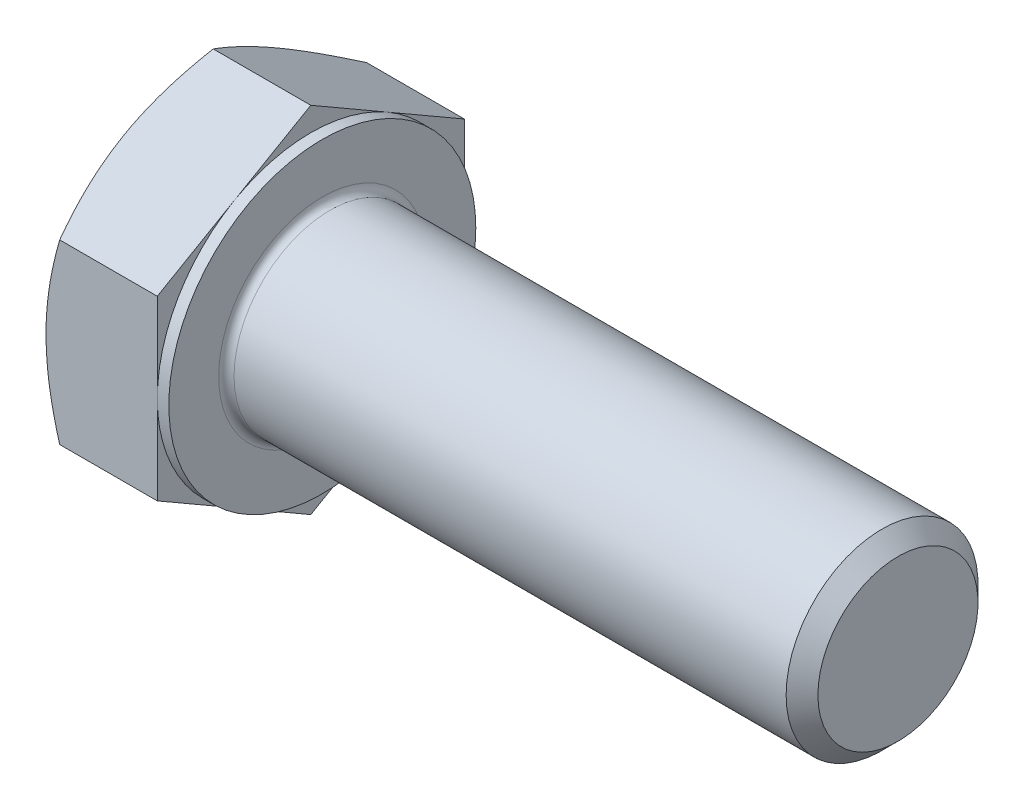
ISO-10303-21;
HEADER;
FILE_DESCRIPTION(('STEP AP214'),'2;1');
FILE_NAME('part.step','',(''),(''),'','','');
FILE_SCHEMA(('AUTOMOTIVE_DESIGN { 1 0 10303 214 1 1 1 1 }'));
ENDSEC;
DATA;
#1=APPLICATION_CONTEXT('core data for automotive mechanical design processes');
#2=APPLICATION_PROTOCOL_DEFINITION('international standard','automotive_design',2000,#1);
#3=PRODUCT_CONTEXT('',#1,'mechanical');
#4=PRODUCT('Part','Part','',(#3));
#5=PRODUCT_RELATED_PRODUCT_CATEGORY('part','',(#4));
#6=PRODUCT_DEFINITION_FORMATION('','',#4);
#7=PRODUCT_DEFINITION_CONTEXT('part definition',#1,'design');
#8=PRODUCT_DEFINITION('design','',#6,#7);
#9=PRODUCT_DEFINITION_SHAPE('','',#8);
#10=(LENGTH_UNIT() NAMED_UNIT(*) SI_UNIT(.MILLI.,.METRE.));
#11=(NAMED_UNIT(*) PLANE_ANGLE_UNIT() SI_UNIT($,.RADIAN.));
#12=(NAMED_UNIT(*) SI_UNIT($,.STERADIAN.) SOLID_ANGLE_UNIT());
#13=UNCERTAINTY_MEASURE_WITH_UNIT(LENGTH_MEASURE(1.E-05),#10,'distance_accuracy_value','');
#14=(GEOMETRIC_REPRESENTATION_CONTEXT(3) GLOBAL_UNCERTAINTY_ASSIGNED_CONTEXT((#13)) GLOBAL_UNIT_ASSIGNED_CONTEXT((#10,
#11,#12)) REPRESENTATION_CONTEXT('',''));
#15=CARTESIAN_POINT('',(0.,0.,0.));
#16=DIRECTION('',(0.,0.,1.));
#17=DIRECTION('',(1.,0.,0.));
#18=AXIS2_PLACEMENT_3D('',#15,#16,#17);
#19=CARTESIAN_POINT('',(6.4,9.23760430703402,0.));
#20=DIRECTION('',(1.,0.,0.));
#21=DIRECTION('',(0.,0.,-1.));
#22=AXIS2_PLACEMENT_3D('',#19,#20,#21);
#23=PLANE('',#22);
#24=CARTESIAN_POINT('',(6.4,0.,0.));
#25=DIRECTION('',(1.,0.,0.));
#26=DIRECTION('',(0.,0.,-1.));
#27=AXIS2_PLACEMENT_3D('',#24,#25,#26);
#28=CIRCLE('',#27,5.4);
#29=CARTESIAN_POINT('',(6.4,0.,-5.4));
#30=VERTEX_POINT('',#29);
#31=EDGE_CURVE('E35',#30,#30,#28,.F.);
#32=ORIENTED_EDGE('',*,*,#31,.T.);
#33=EDGE_LOOP('',(#32));
#34=FACE_BOUND('',#33,.T.);
#35=CARTESIAN_POINT('',(6.4,0.,0.));
#36=DIRECTION('',(1.,0.,0.));
#37=DIRECTION('',(0.,0.,-1.));
#38=AXIS2_PLACEMENT_3D('',#35,#36,#37);
#39=CIRCLE('',#38,8.);
#40=CARTESIAN_POINT('',(6.4,0.,-8.));
#41=VERTEX_POINT('',#40);
#42=EDGE_CURVE('E248',#41,#41,#39,.T.);
#43=ORIENTED_EDGE('',*,*,#42,.T.);
#44=EDGE_LOOP('',(#43));
#45=FACE_BOUND('',#44,.T.);
#46=ADVANCED_FACE('F26',(#34,#45),#23,.T.);
#47=CARTESIAN_POINT('',(0.,0.,0.));
#48=DIRECTION('',(-1.,0.,0.));
#49=DIRECTION('',(0.,0.,1.));
#50=AXIS2_PLACEMENT_3D('',#47,#48,#49);
#51=CYLINDRICAL_SURFACE('',#50,5.);
#52=CARTESIAN_POINT('',(6.8,0.,0.));
#53=DIRECTION('',(1.,0.,0.));
#54=DIRECTION('',(0.,0.,-1.));
#55=AXIS2_PLACEMENT_3D('',#52,#53,#54);
#56=CIRCLE('',#55,5.);
#57=CARTESIAN_POINT('',(6.8,0.,-5.));
#58=VERTEX_POINT('',#57);
#59=EDGE_CURVE('E11',#58,#58,#56,.T.);
#60=ORIENTED_EDGE('',*,*,#59,.T.);
#61=EDGE_LOOP('',(#60));
#62=FACE_BOUND('',#61,.T.);
#63=CARTESIAN_POINT('',(35.572,0.,0.));
#64=DIRECTION('',(-1.,0.,0.));
#65=DIRECTION('',(0.,0.,1.));
#66=AXIS2_PLACEMENT_3D('',#63,#64,#65);
#67=CIRCLE('',#66,5.);
#68=CARTESIAN_POINT('',(35.572,0.,5.));
#69=VERTEX_POINT('',#68);
#70=EDGE_CURVE('E292',#69,#69,#67,.T.);
#71=ORIENTED_EDGE('',*,*,#70,.T.);
#72=EDGE_LOOP('',(#71));
#73=FACE_BOUND('',#72,.T.);
#74=ADVANCED_FACE('F235',(#62,#73),#51,.T.);
#75=CARTESIAN_POINT('',(36.4,0.,0.));
#76=DIRECTION('',(-1.,0.,0.));
#77=DIRECTION('',(0.,0.,1.));
#78=AXIS2_PLACEMENT_3D('',#75,#76,#77);
#79=CONICAL_SURFACE('',#78,4.172,0.78539816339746);
#80=ORIENTED_EDGE('',*,*,#70,.F.);
#81=EDGE_LOOP('',(#80));
#82=FACE_BOUND('',#81,.T.);
#83=CARTESIAN_POINT('',(36.4,0.,0.));
#84=DIRECTION('',(-1.,0.,0.));
#85=DIRECTION('',(0.,0.,1.));
#86=AXIS2_PLACEMENT_3D('',#83,#84,#85);
#87=CIRCLE('',#86,4.172);
#88=CARTESIAN_POINT('',(36.4,0.,4.172));
#89=VERTEX_POINT('',#88);
#90=EDGE_CURVE('E294',#89,#89,#87,.T.);
#91=ORIENTED_EDGE('',*,*,#90,.T.);
#92=EDGE_LOOP('',(#91));
#93=FACE_BOUND('',#92,.T.);
#94=ADVANCED_FACE('F240',(#82,#93),#79,.T.);
#95=CARTESIAN_POINT('',(36.4,0.,0.));
#96=DIRECTION('',(-1.,0.,0.));
#97=DIRECTION('',(0.,0.,1.));
#98=AXIS2_PLACEMENT_3D('',#95,#96,#97);
#99=PLANE('',#98);
#100=ORIENTED_EDGE('',*,*,#90,.F.);
#101=EDGE_LOOP('',(#100));
#102=FACE_BOUND('',#101,.T.);
#103=ADVANCED_FACE('F341',(#102),#99,.F.);
#104=CARTESIAN_POINT('',(5.8,8.,0.));
#105=DIRECTION('',(1.,0.,0.));
#106=DIRECTION('',(0.,0.,-1.));
#107=AXIS2_PLACEMENT_3D('',#104,#105,#106);
#108=PLANE('',#107);
#109=DIRECTION('',(0.,0.500000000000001,0.866025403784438));
#110=VECTOR('',#109,1.);
#111=CARTESIAN_POINT('',(5.8,4.618802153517,-8.));
#112=LINE('',#111,#110);
#113=CARTESIAN_POINT('',(5.8,4.618802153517,-8.));
#114=VERTEX_POINT('',#113);
#115=CARTESIAN_POINT('',(5.8,6.92820323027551,-4.00000000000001));
#116=VERTEX_POINT('',#115);
#117=EDGE_CURVE('E159',#114,#116,#112,.T.);
#118=ORIENTED_EDGE('',*,*,#117,.T.);
#119=CARTESIAN_POINT('',(5.8,0.,0.));
#120=DIRECTION('',(-1.,0.,0.));
#121=DIRECTION('',(0.,0.,1.));
#122=AXIS2_PLACEMENT_3D('',#119,#120,#121);
#123=CIRCLE('',#122,8.);
#124=CARTESIAN_POINT('',(5.8,0.,-8.));
#125=VERTEX_POINT('',#124);
#126=EDGE_CURVE('E42',#116,#125,#123,.T.);
#127=ORIENTED_EDGE('',*,*,#126,.T.);
#128=DIRECTION('',(0.,1.,0.));
#129=VECTOR('',#128,1.);
#130=CARTESIAN_POINT('',(5.8,4.618802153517,-8.));
#131=LINE('',#130,#129);
#132=EDGE_CURVE('E249',#125,#114,#131,.T.);
#133=ORIENTED_EDGE('',*,*,#132,.T.);
#134=EDGE_LOOP('',(#118,#127,#133));
#135=FACE_BOUND('',#134,.T.);
#136=ADVANCED_FACE('F271',(#135),#108,.T.);
#137=CARTESIAN_POINT('',(5.8,9.23760430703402,0.));
#138=VERTEX_POINT('',#137);
#139=EDGE_CURVE('E157',#116,#138,#112,.T.);
#140=ORIENTED_EDGE('',*,*,#139,.T.);
#141=DIRECTION('',(0.,-0.500000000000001,0.866025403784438));
#142=VECTOR('',#141,1.);
#143=CARTESIAN_POINT('',(5.8,9.23760430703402,0.));
#144=LINE('',#143,#142);
#145=CARTESIAN_POINT('',(5.8,6.92820323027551,4.00000000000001));
#146=VERTEX_POINT('',#145);
#147=EDGE_CURVE('E156',#138,#146,#144,.T.);
#148=ORIENTED_EDGE('',*,*,#147,.T.);
#149=EDGE_CURVE('E145',#146,#116,#123,.T.);
#150=ORIENTED_EDGE('',*,*,#149,.T.);
#151=EDGE_LOOP('',(#140,#148,#150));
#152=FACE_BOUND('',#151,.T.);
#153=ADVANCED_FACE('F278',(#152),#108,.T.);
#154=CARTESIAN_POINT('',(5.8,4.61880215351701,8.));
#155=VERTEX_POINT('',#154);
#156=EDGE_CURVE('E124',#146,#155,#144,.T.);
#157=ORIENTED_EDGE('',*,*,#156,.T.);
#158=DIRECTION('',(0.,-1.,0.));
#159=VECTOR('',#158,1.);
#160=CARTESIAN_POINT('',(5.8,4.61880215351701,8.));
#161=LINE('',#160,#159);
#162=CARTESIAN_POINT('',(5.8,0.,8.));
#163=VERTEX_POINT('',#162);
#164=EDGE_CURVE('E118',#155,#163,#161,.T.);
#165=ORIENTED_EDGE('',*,*,#164,.T.);
#166=EDGE_CURVE('E122',#163,#146,#123,.T.);
#167=ORIENTED_EDGE('',*,*,#166,.T.);
#168=EDGE_LOOP('',(#157,#165,#167));
#169=FACE_BOUND('',#168,.T.);
#170=ADVANCED_FACE('F120',(#169),#108,.T.);
#171=CARTESIAN_POINT('',(5.8,-4.61880215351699,8.));
#172=VERTEX_POINT('',#171);
#173=EDGE_CURVE('E128',#163,#172,#161,.T.);
#174=ORIENTED_EDGE('',*,*,#173,.T.);
#175=DIRECTION('',(0.,-0.500000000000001,-0.866025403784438));
#176=VECTOR('',#175,1.);
#177=CARTESIAN_POINT('',(5.8,-9.23760430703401,0.));
#178=LINE('',#177,#176);
#179=CARTESIAN_POINT('',(5.8,-6.92820323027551,4.00000000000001));
#180=VERTEX_POINT('',#179);
#181=EDGE_CURVE('E135',#172,#180,#178,.T.);
#182=ORIENTED_EDGE('',*,*,#181,.T.);
#183=EDGE_CURVE('E132',#180,#163,#123,.T.);
#184=ORIENTED_EDGE('',*,*,#183,.T.);
#185=EDGE_LOOP('',(#174,#182,#184));
#186=FACE_BOUND('',#185,.T.);
#187=ADVANCED_FACE('F133',(#186),#108,.T.);
#188=CARTESIAN_POINT('',(5.8,-9.23760430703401,0.));
#189=VERTEX_POINT('',#188);
#190=EDGE_CURVE('E151',#180,#189,#178,.T.);
#191=ORIENTED_EDGE('',*,*,#190,.T.);
#192=DIRECTION('',(0.,0.5,-0.866025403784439));
#193=VECTOR('',#192,1.);
#194=CARTESIAN_POINT('',(5.8,-4.61880215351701,-8.));
#195=LINE('',#194,#193);
#196=CARTESIAN_POINT('',(5.8,-6.92820323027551,-4.));
#197=VERTEX_POINT('',#196);
#198=EDGE_CURVE('E332',#189,#197,#195,.T.);
#199=ORIENTED_EDGE('',*,*,#198,.T.);
#200=EDGE_CURVE('E139',#197,#180,#123,.T.);
#201=ORIENTED_EDGE('',*,*,#200,.T.);
#202=EDGE_LOOP('',(#191,#199,#201));
#203=FACE_BOUND('',#202,.T.);
#204=ADVANCED_FACE('F333',(#203),#108,.T.);
#205=CARTESIAN_POINT('',(5.8,-4.61880215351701,-8.));
#206=VERTEX_POINT('',#205);
#207=EDGE_CURVE('E146',#197,#206,#195,.T.);
#208=ORIENTED_EDGE('',*,*,#207,.T.);
#209=EDGE_CURVE('E252',#206,#125,#131,.T.);
#210=ORIENTED_EDGE('',*,*,#209,.T.);
#211=EDGE_CURVE('E264',#125,#197,#123,.T.);
#212=ORIENTED_EDGE('',*,*,#211,.T.);
#213=EDGE_LOOP('',(#208,#210,#212));
#214=FACE_BOUND('',#213,.T.);
#215=ADVANCED_FACE('F263',(#214),#108,.T.);
#216=CARTESIAN_POINT('',(0.,0.,0.));
#217=DIRECTION('',(-1.,0.,0.));
#218=DIRECTION('',(0.,0.,1.));
#219=AXIS2_PLACEMENT_3D('',#216,#217,#218);
#220=CYLINDRICAL_SURFACE('',#219,8.);
#221=ORIENTED_EDGE('',*,*,#126,.F.);
#222=ORIENTED_EDGE('',*,*,#149,.F.);
#223=ORIENTED_EDGE('',*,*,#166,.F.);
#224=ORIENTED_EDGE('',*,*,#183,.F.);
#225=ORIENTED_EDGE('',*,*,#200,.F.);
#226=ORIENTED_EDGE('',*,*,#211,.F.);
#227=EDGE_LOOP('',(#221,#222,#223,#224,#225,#226));
#228=FACE_BOUND('',#227,.T.);
#229=ORIENTED_EDGE('',*,*,#42,.F.);
#230=EDGE_LOOP('',(#229));
#231=FACE_BOUND('',#230,.T.);
#232=ADVANCED_FACE('F142',(#228,#231),#220,.T.);
#233=CARTESIAN_POINT('',(0.,9.23760430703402,0.));
#234=DIRECTION('',(1.,0.,0.));
#235=DIRECTION('',(0.,0.,-1.));
#236=AXIS2_PLACEMENT_3D('',#233,#234,#235);
#237=PLANE('',#236);
#238=CARTESIAN_POINT('',(0.,0.,0.));
#239=DIRECTION('',(1.,0.,0.));
#240=DIRECTION('',(0.,0.,-1.));
#241=AXIS2_PLACEMENT_3D('',#238,#239,#240);
#242=CIRCLE('',#241,8.);
#243=CARTESIAN_POINT('',(0.,0.,-8.));
#244=VERTEX_POINT('',#243);
#245=CARTESIAN_POINT('',(0.,6.92820323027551,-4.00000000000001));
#246=VERTEX_POINT('',#245);
#247=EDGE_CURVE('E250',#244,#246,#242,.T.);
#248=ORIENTED_EDGE('',*,*,#247,.F.);
#249=CARTESIAN_POINT('',(0.,-6.92820323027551,-4.));
#250=VERTEX_POINT('',#249);
#251=EDGE_CURVE('E256',#250,#244,#242,.T.);
#252=ORIENTED_EDGE('',*,*,#251,.F.);
#253=CARTESIAN_POINT('',(0.,-6.9282032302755,4.00000000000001));
#254=VERTEX_POINT('',#253);
#255=EDGE_CURVE('E314',#254,#250,#242,.T.);
#256=ORIENTED_EDGE('',*,*,#255,.F.);
#257=CARTESIAN_POINT('',(0.,0.,8.));
#258=VERTEX_POINT('',#257);
#259=EDGE_CURVE('E310',#258,#254,#242,.T.);
#260=ORIENTED_EDGE('',*,*,#259,.F.);
#261=CARTESIAN_POINT('',(0.,0.,0.));
#262=DIRECTION('',(-1.,0.,0.));
#263=DIRECTION('',(0.,0.,1.));
#264=AXIS2_PLACEMENT_3D('',#261,#262,#263);
#265=CIRCLE('',#264,8.);
#266=CARTESIAN_POINT('',(0.,6.92820323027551,4.00000000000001));
#267=VERTEX_POINT('',#266);
#268=EDGE_CURVE('E160',#258,#267,#265,.T.);
#269=ORIENTED_EDGE('',*,*,#268,.T.);
#270=EDGE_CURVE('E254',#246,#267,#242,.T.);
#271=ORIENTED_EDGE('',*,*,#270,.F.);
#272=EDGE_LOOP('',(#248,#252,#256,#260,#269,#271));
#273=FACE_BOUND('',#272,.T.);
#274=ADVANCED_FACE('F311',(#273),#237,.F.);
#275=CARTESIAN_POINT('',(0.,0.,0.));
#276=DIRECTION('',(1.,0.,0.));
#277=DIRECTION('',(0.,0.,-1.));
#278=AXIS2_PLACEMENT_3D('',#275,#276,#277);
#279=CONICAL_SURFACE('',#278,8.,1.0471975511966);
#280=CARTESIAN_POINT('',(0.714597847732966,4.61868668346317,8.0002));
#281=CARTESIAN_POINT('',(0.655990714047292,4.72021302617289,7.8243512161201));
#282=CARTESIAN_POINT('',(0.600043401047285,4.82211789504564,7.64784680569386));
#283=CARTESIAN_POINT('',(0.494201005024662,5.02675523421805,7.29340453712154));
#284=CARTESIAN_POINT('',(0.444308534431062,5.12948804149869,7.11546609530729));
#285=CARTESIAN_POINT('',(0.304692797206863,5.43933133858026,6.57880176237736));
#286=CARTESIAN_POINT('',(0.225281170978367,5.64766491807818,6.21795741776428));
#287=CARTESIAN_POINT('',(0.132161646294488,5.95943209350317,5.67796082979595));
#288=CARTESIAN_POINT('',(0.105634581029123,6.06193429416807,5.50042181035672));
#289=CARTESIAN_POINT('',(0.0611531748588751,6.26740224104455,5.1445408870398));
#290=CARTESIAN_POINT('',(0.04319807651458,6.37036794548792,4.96619905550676));
#291=CARTESIAN_POINT('',(0.0163156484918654,6.57647664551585,4.60920831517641));
#292=CARTESIAN_POINT('',(0.00737807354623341,6.67961930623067,4.4305599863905));
#293=CARTESIAN_POINT('',(-0.00127769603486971,6.88599991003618,4.07309829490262));
#294=CARTESIAN_POINT('',(-0.000996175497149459,6.98923785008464,3.89428493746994));
#295=CARTESIAN_POINT('',(0.00814502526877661,7.18224506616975,3.5599866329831));
#296=CARTESIAN_POINT('',(0.0158896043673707,7.27202796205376,3.40447809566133));
#297=CARTESIAN_POINT('',(0.0382011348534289,7.45138347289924,3.09382523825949));
#298=CARTESIAN_POINT('',(0.0527685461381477,7.54095607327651,2.93868094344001));
#299=CARTESIAN_POINT('',(0.106360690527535,7.80932710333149,2.47384868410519));
#300=CARTESIAN_POINT('',(0.155268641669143,7.98765049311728,2.16498351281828));
#301=CARTESIAN_POINT('',(0.277539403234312,8.34618890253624,1.5439767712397));
#302=CARTESIAN_POINT('',(0.351420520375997,8.52635816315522,1.23191445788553));
#303=CARTESIAN_POINT('',(0.519100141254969,8.88400987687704,0.612443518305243));
#304=CARTESIAN_POINT('',(0.612859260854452,9.06149691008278,0.30502695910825));
#305=CARTESIAN_POINT('',(0.714597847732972,9.23771977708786,-0.00019999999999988));
#306=B_SPLINE_CURVE_WITH_KNOTS('',3,(#280,#281,#282,#283,#284,#285,#286,#287,#288,#289,#290,
#291,#292,#293,#294,#295,#296,#297,#298,#299,#300,#301,#302,#303,#304,#305),.UNSPECIFIED.,.F.,
.F.,(4,2,2,2,2,2,2,2,2,2,2,2,4),(0.,0.633973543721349,1.26821965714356,2.53934712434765,
3.15934343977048,3.77928496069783,4.39852133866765,5.01773858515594,5.55680239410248,
6.09590254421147,7.17487077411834,8.27776850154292,9.37850115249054),.UNSPECIFIED.);
#307=CARTESIAN_POINT('',(0.714531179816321,9.23760430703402,0.));
#308=VERTEX_POINT('',#307);
#309=EDGE_CURVE('E206',#267,#308,#306,.T.);
#310=ORIENTED_EDGE('',*,*,#309,.T.);
#311=CARTESIAN_POINT('',(0.714597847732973,9.23771977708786,0.0002));
#312=CARTESIAN_POINT('',(0.655990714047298,9.13619343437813,-0.175648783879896));
#313=CARTESIAN_POINT('',(0.60004340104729,9.03428856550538,-0.352153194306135));
#314=CARTESIAN_POINT('',(0.494201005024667,8.82965122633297,-0.706595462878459));
#315=CARTESIAN_POINT('',(0.444308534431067,8.72691841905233,-0.884533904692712));
#316=CARTESIAN_POINT('',(0.304692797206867,8.41707512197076,-1.42119823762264));
#317=CARTESIAN_POINT('',(0.22528117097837,8.20874154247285,-1.78204258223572));
#318=CARTESIAN_POINT('',(0.13216164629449,7.89697436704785,-2.32203917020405));
#319=CARTESIAN_POINT('',(0.105634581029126,7.79447216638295,-2.49957818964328));
#320=CARTESIAN_POINT('',(0.0611531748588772,7.58900421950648,-2.8554591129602));
#321=CARTESIAN_POINT('',(0.0431980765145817,7.4860385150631,-3.03380094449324));
#322=CARTESIAN_POINT('',(0.0163156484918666,7.27992981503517,-3.39079168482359));
#323=CARTESIAN_POINT('',(0.00737807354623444,7.17678715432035,-3.5694400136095));
#324=CARTESIAN_POINT('',(-0.00127769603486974,6.97040655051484,-3.92690170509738));
#325=CARTESIAN_POINT('',(-0.00099617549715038,6.86716861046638,-4.10571506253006));
#326=CARTESIAN_POINT('',(0.00814502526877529,6.67416139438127,-4.4400133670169));
#327=CARTESIAN_POINT('',(0.0158896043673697,6.58437849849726,-4.59552190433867));
#328=CARTESIAN_POINT('',(0.0382011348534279,6.40502298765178,-4.90617476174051));
#329=CARTESIAN_POINT('',(0.0527685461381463,6.31545038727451,-5.06131905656));
#330=CARTESIAN_POINT('',(0.106360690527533,6.04707935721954,-5.52615131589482));
#331=CARTESIAN_POINT('',(0.155268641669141,5.86875596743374,-5.83501648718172));
#332=CARTESIAN_POINT('',(0.277539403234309,5.51021755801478,-6.4560232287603));
#333=CARTESIAN_POINT('',(0.351420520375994,5.3300482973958,-6.76808554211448));
#334=CARTESIAN_POINT('',(0.519100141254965,4.97239658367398,-7.38755648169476));
#335=CARTESIAN_POINT('',(0.612859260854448,4.79490955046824,-7.69497304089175));
#336=CARTESIAN_POINT('',(0.714597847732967,4.61868668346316,-8.0002));
#337=B_SPLINE_CURVE_WITH_KNOTS('',3,(#311,#312,#313,#314,#315,#316,#317,#318,#319,#320,#321,
#322,#323,#324,#325,#326,#327,#328,#329,#330,#331,#332,#333,#334,#335,#336),.UNSPECIFIED.,.F.,
.F.,(4,2,2,2,2,2,2,2,2,2,2,2,4),(0.,0.633973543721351,1.26821965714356,2.53934712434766,
3.15934343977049,3.77928496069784,4.39852133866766,5.01773858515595,5.55680239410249,
6.09590254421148,7.17487077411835,8.27776850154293,9.37850115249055),.UNSPECIFIED.);
#338=EDGE_CURVE('E50',#308,#246,#337,.T.);
#339=ORIENTED_EDGE('',*,*,#338,.T.);
#340=ORIENTED_EDGE('',*,*,#270,.T.);
#341=EDGE_LOOP('',(#310,#339,#340));
#342=FACE_BOUND('',#341,.T.);
#343=ADVANCED_FACE('F308',(#342),#279,.T.);
#344=CARTESIAN_POINT('',(4.02490591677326,-12.6546855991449,8.));
#345=CARTESIAN_POINT('',(3.85338488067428,-12.3031246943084,8.));
#346=CARTESIAN_POINT('',(3.68343820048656,-11.9507829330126,8.));
#347=CARTESIAN_POINT('',(3.3475742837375,-11.2441233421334,8.));
#348=CARTESIAN_POINT('',(3.18165763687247,-10.8898052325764,8.));
#349=CARTESIAN_POINT('',(2.85395194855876,-10.1770689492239,8.));
#350=CARTESIAN_POINT('',(2.69218825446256,-9.81863908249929,8.));
#351=CARTESIAN_POINT('',(2.37495727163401,-9.09901413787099,8.));
#352=CARTESIAN_POINT('',(2.21948970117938,-8.73781918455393,8.));
#353=CARTESIAN_POINT('',(1.91124909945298,-7.9995005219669,8.));
#354=CARTESIAN_POINT('',(1.75875676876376,-7.6222589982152,8.));
#355=CARTESIAN_POINT('',(1.46472411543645,-6.86345577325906,8.));
#356=CARTESIAN_POINT('',(1.323184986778,-6.48189360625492,8.));
#357=CARTESIAN_POINT('',(1.05459432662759,-5.71447512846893,8.));
#358=CARTESIAN_POINT('',(0.927515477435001,-5.32862847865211,8.));
#359=CARTESIAN_POINT('',(0.69175721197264,-4.55141880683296,8.));
#360=CARTESIAN_POINT('',(0.583072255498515,-4.16005748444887,8.));
#361=CARTESIAN_POINT('',(0.389750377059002,-3.37376378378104,8.));
#362=CARTESIAN_POINT('',(0.304973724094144,-2.97886668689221,8.));
#363=CARTESIAN_POINT('',(0.199275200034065,-2.38273452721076,8.));
#364=CARTESIAN_POINT('',(0.167618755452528,-2.18337977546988,8.));
#365=CARTESIAN_POINT('',(0.112075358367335,-1.78359737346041,8.));
#366=CARTESIAN_POINT('',(0.0881876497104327,-1.58316982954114,8.));
#367=CARTESIAN_POINT('',(0.0489706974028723,-1.184235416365,8.));
#368=CARTESIAN_POINT('',(0.0335291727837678,-0.985739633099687,8.));
#369=CARTESIAN_POINT('',(0.0110629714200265,-0.58827208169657,8.));
#370=CARTESIAN_POINT('',(0.00403814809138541,-0.38930032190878,8.));
#371=CARTESIAN_POINT('',(-0.00142584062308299,0.00876221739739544,8.));
#372=CARTESIAN_POINT('',(0.000134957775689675,0.207852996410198,8.));
#373=CARTESIAN_POINT('',(0.0118014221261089,0.605786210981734,8.));
#374=CARTESIAN_POINT('',(0.0219074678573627,0.804628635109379,8.));
#375=CARTESIAN_POINT('',(0.0557165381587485,1.27520492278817,8.));
#376=CARTESIAN_POINT('',(0.0830672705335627,1.5466829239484,8.));
#377=CARTESIAN_POINT('',(0.152259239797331,2.08777093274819,8.));
#378=CARTESIAN_POINT('',(0.194102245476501,2.35738070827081,8.));
#379=CARTESIAN_POINT('',(0.33916319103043,3.1630177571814,7.99999999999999));
#380=CARTESIAN_POINT('',(0.461891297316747,3.69558689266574,8.));
#381=CARTESIAN_POINT('',(0.676586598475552,4.49226054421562,8.));
#382=CARTESIAN_POINT('',(0.754301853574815,4.76044513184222,8.));
#383=CARTESIAN_POINT('',(0.918275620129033,5.29421545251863,8.));
#384=CARTESIAN_POINT('',(1.00453419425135,5.55980116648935,8.));
#385=CARTESIAN_POINT('',(1.1841720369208,6.08844838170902,8.));
#386=CARTESIAN_POINT('',(1.27754932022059,6.35151056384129,8.));
#387=CARTESIAN_POINT('',(1.47027925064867,6.8754242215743,8.));
#388=CARTESIAN_POINT('',(1.56963178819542,7.1362757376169,7.99999999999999));
#389=CARTESIAN_POINT('',(1.83061788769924,7.80218876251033,7.99999999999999));
#390=CARTESIAN_POINT('',(1.99585031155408,8.20583801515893,7.99999999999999));
#391=CARTESIAN_POINT('',(2.33560644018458,9.00922091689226,7.99999999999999));
#392=CARTESIAN_POINT('',(2.51013099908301,9.40895420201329,7.99999999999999));
#393=CARTESIAN_POINT('',(2.86641485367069,10.2053302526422,7.99999999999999));
#394=CARTESIAN_POINT('',(3.04817649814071,10.6019719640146,7.99999999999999));
#395=CARTESIAN_POINT('',(3.41731475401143,11.3926098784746,7.99999999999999));
#396=CARTESIAN_POINT('',(3.60469118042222,11.7866061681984,7.99999999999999));
#397=CARTESIAN_POINT('',(3.98417977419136,12.5730081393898,7.99999999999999));
#398=CARTESIAN_POINT('',(4.17629838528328,12.9654107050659,7.99999999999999));
#399=CARTESIAN_POINT('',(4.56413461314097,13.7484335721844,7.99999999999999));
#400=CARTESIAN_POINT('',(4.75985225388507,14.1390538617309,7.99999999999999));
#401=CARTESIAN_POINT('',(5.15417791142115,14.9187387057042,7.99999999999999));
#402=CARTESIAN_POINT('',(5.35278537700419,15.3078035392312,7.99999999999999));
#403=CARTESIAN_POINT('',(5.75241278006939,16.0846929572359,7.99999999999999));
#404=CARTESIAN_POINT('',(5.95343272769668,16.4725175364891,7.99999999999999));
#405=CARTESIAN_POINT('',(6.52023158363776,17.559169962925,7.99999999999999));
#406=CARTESIAN_POINT('',(6.88826669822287,18.2568208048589,7.99999999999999));
#407=CARTESIAN_POINT('',(7.62911646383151,19.6496204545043,7.99999999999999));
#408=CARTESIAN_POINT('',(8.00193136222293,20.3447691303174,7.99999999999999));
#409=CARTESIAN_POINT('',(8.74998840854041,21.7309493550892,7.99999999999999));
#410=CARTESIAN_POINT('',(9.12521930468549,22.4219869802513,7.99999999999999));
#411=CARTESIAN_POINT('',(9.69012626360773,23.4573861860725,7.99999999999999));
#412=CARTESIAN_POINT('',(9.87876537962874,23.8023143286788,7.99999999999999));
#413=CARTESIAN_POINT('',(10.2566598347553,24.491832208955,7.99999999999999));
#414=CARTESIAN_POINT('',(10.4459151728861,24.8364219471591,7.99999999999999));
#415=CARTESIAN_POINT('',(10.6354414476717,25.1808626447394,7.99999999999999));
#416=B_SPLINE_CURVE_WITH_KNOTS('',3,(#344,#345,#346,#347,#348,#349,#350,#351,#352,#353,#354,
#355,#356,#357,#358,#359,#360,#361,#362,#363,#364,#365,#366,#367,#368,#369,#370,#371,#372,#373,
#374,#375,#376,#377,#378,#379,#380,#381,#382,#383,#384,#385,#386,#387,#388,#389,#390,#391,#392,
#393,#394,#395,#396,#397,#398,#399,#400,#401,#402,#403,#404,#405,#406,#407,#408,#409,#410,#411,
#412,#413,#414,#415),.UNSPECIFIED.,.F.,.F.,(4,2,2,2,2,2,2,2,2,2,2,2,2,2,2,2,2,2,2,2,2,2,2,2,2,2,
2,2,2,2,2,2,2,2,2,4),(0.,1.17352534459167,2.34722138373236,3.52689945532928,4.70652468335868,
5.92708318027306,7.14777454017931,8.36612013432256,9.58409810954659,10.7948027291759,
11.40023293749,12.0056041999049,12.6027191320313,13.1998236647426,13.7969256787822,
14.3940542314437,15.2121538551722,16.0303533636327,17.6675489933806,18.5051258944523,
19.3427089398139,20.180059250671,21.0173942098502,22.3257038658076,23.6341339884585,
24.9429922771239,26.2518074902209,27.5625113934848,28.8732240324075,30.1836898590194,
31.4941611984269,33.8604586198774,36.2268790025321,38.5858914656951,39.7653151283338,
40.9447369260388),.UNSPECIFIED.);
#417=CARTESIAN_POINT('',(0.714531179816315,4.61880215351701,8.));
#418=VERTEX_POINT('',#417);
#419=EDGE_CURVE('E218',#258,#418,#416,.T.);
#420=ORIENTED_EDGE('',*,*,#419,.T.);
#421=EDGE_CURVE('E217',#418,#267,#306,.T.);
#422=ORIENTED_EDGE('',*,*,#421,.T.);
#423=ORIENTED_EDGE('',*,*,#268,.F.);
#424=EDGE_LOOP('',(#420,#422,#423));
#425=FACE_BOUND('',#424,.T.);
#426=ADVANCED_FACE('F305',(#425),#279,.T.);
#427=CARTESIAN_POINT('',(0.714531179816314,-4.61880215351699,8.));
#428=VERTEX_POINT('',#427);
#429=EDGE_CURVE('E296',#428,#258,#416,.T.);
#430=ORIENTED_EDGE('',*,*,#429,.T.);
#431=ORIENTED_EDGE('',*,*,#259,.T.);
#432=CARTESIAN_POINT('',(0.714597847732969,-9.23771977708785,-0.000199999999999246));
#433=CARTESIAN_POINT('',(0.655990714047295,-9.13619343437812,0.175648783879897));
#434=CARTESIAN_POINT('',(0.600043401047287,-9.03428856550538,0.352153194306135));
#435=CARTESIAN_POINT('',(0.494201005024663,-8.82965122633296,0.706595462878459));
#436=CARTESIAN_POINT('',(0.444308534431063,-8.72691841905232,0.884533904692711));
#437=CARTESIAN_POINT('',(0.304692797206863,-8.41707512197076,1.42119823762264));
#438=CARTESIAN_POINT('',(0.225281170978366,-8.20874154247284,1.78204258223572));
#439=CARTESIAN_POINT('',(0.132161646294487,-7.89697436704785,2.32203917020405));
#440=CARTESIAN_POINT('',(0.105634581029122,-7.79447216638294,2.49957818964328));
#441=CARTESIAN_POINT('',(0.0611531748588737,-7.58900421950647,2.8554591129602));
#442=CARTESIAN_POINT('',(0.0431980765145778,-7.4860385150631,3.03380094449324));
#443=CARTESIAN_POINT('',(0.0163156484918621,-7.27992981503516,3.39079168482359));
#444=CARTESIAN_POINT('',(0.00737807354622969,-7.17678715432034,3.5694400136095));
#445=CARTESIAN_POINT('',(-0.00127769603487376,-6.97040655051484,3.92690170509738));
#446=CARTESIAN_POINT('',(-0.000996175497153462,-6.86716861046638,4.10571506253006));
#447=CARTESIAN_POINT('',(0.00814502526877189,-6.67416139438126,4.4400133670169));
#448=CARTESIAN_POINT('',(0.0158896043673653,-6.58437849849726,4.59552190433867));
#449=CARTESIAN_POINT('',(0.0382011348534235,-6.40502298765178,4.90617476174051));
#450=CARTESIAN_POINT('',(0.052768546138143,-6.31545038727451,5.06131905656));
#451=CARTESIAN_POINT('',(0.106360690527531,-6.04707935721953,5.52615131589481));
#452=CARTESIAN_POINT('',(0.155268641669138,-5.86875596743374,5.83501648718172));
#453=CARTESIAN_POINT('',(0.277539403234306,-5.51021755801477,6.4560232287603));
#454=CARTESIAN_POINT('',(0.351420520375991,-5.3300482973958,6.76808554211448));
#455=CARTESIAN_POINT('',(0.519100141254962,-4.97239658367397,7.38755648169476));
#456=CARTESIAN_POINT('',(0.612859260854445,-4.79490955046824,7.69497304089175));
#457=CARTESIAN_POINT('',(0.714597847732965,-4.61868668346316,8.0002));
#458=B_SPLINE_CURVE_WITH_KNOTS('',3,(#432,#433,#434,#435,#436,#437,#438,#439,#440,#441,#442,
#443,#444,#445,#446,#447,#448,#449,#450,#451,#452,#453,#454,#455,#456,#457),.UNSPECIFIED.,.F.,
.F.,(4,2,2,2,2,2,2,2,2,2,2,2,4),(0.,0.63397354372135,1.26821965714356,2.53934712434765,
3.15934343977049,3.77928496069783,4.39852133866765,5.01773858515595,5.55680239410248,
6.09590254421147,7.17487077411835,8.27776850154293,9.37850115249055),.UNSPECIFIED.);
#459=EDGE_CURVE('E208',#254,#428,#458,.T.);
#460=ORIENTED_EDGE('',*,*,#459,.T.);
#461=EDGE_LOOP('',(#430,#431,#460));
#462=FACE_BOUND('',#461,.T.);
#463=ADVANCED_FACE('F178',(#462),#279,.T.);
#464=CARTESIAN_POINT('',(0.714531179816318,-9.23760430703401,0.));
#465=VERTEX_POINT('',#464);
#466=EDGE_CURVE('E201',#465,#254,#458,.T.);
#467=ORIENTED_EDGE('',*,*,#466,.T.);
#468=ORIENTED_EDGE('',*,*,#255,.T.);
#469=CARTESIAN_POINT('',(0.71459784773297,-4.61868668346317,-8.0002));
#470=CARTESIAN_POINT('',(0.655990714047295,-4.7202130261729,-7.82435121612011));
#471=CARTESIAN_POINT('',(0.600043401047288,-4.82211789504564,-7.64784680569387));
#472=CARTESIAN_POINT('',(0.494201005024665,-5.02675523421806,-7.29340453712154));
#473=CARTESIAN_POINT('',(0.444308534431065,-5.1294880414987,-7.11546609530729));
#474=CARTESIAN_POINT('',(0.304692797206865,-5.43933133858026,-6.57880176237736));
#475=CARTESIAN_POINT('',(0.225281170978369,-5.64766491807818,-6.21795741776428));
#476=CARTESIAN_POINT('',(0.132161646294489,-5.95943209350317,-5.67796082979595));
#477=CARTESIAN_POINT('',(0.105634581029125,-6.06193429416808,-5.50042181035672));
#478=CARTESIAN_POINT('',(0.0611531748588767,-6.26740224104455,-5.1445408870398));
#479=CARTESIAN_POINT('',(0.0431980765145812,-6.37036794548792,-4.96619905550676));
#480=CARTESIAN_POINT('',(0.0163156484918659,-6.57647664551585,-4.60920831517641));
#481=CARTESIAN_POINT('',(0.00737807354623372,-6.67961930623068,-4.4305599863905));
#482=CARTESIAN_POINT('',(-0.00127769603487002,-6.88599991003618,-4.07309829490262));
#483=CARTESIAN_POINT('',(-0.000996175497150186,-6.98923785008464,-3.89428493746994));
#484=CARTESIAN_POINT('',(0.00814502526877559,-7.18224506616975,-3.5599866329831));
#485=CARTESIAN_POINT('',(0.0158896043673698,-7.27202796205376,-3.40447809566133));
#486=CARTESIAN_POINT('',(0.0382011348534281,-7.45138347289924,-3.09382523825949));
#487=CARTESIAN_POINT('',(0.052768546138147,-7.54095607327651,-2.93868094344));
#488=CARTESIAN_POINT('',(0.106360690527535,-7.80932710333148,-2.47384868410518));
#489=CARTESIAN_POINT('',(0.155268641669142,-7.98765049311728,-2.16498351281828));
#490=CARTESIAN_POINT('',(0.27753940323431,-8.34618890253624,-1.5439767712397));
#491=CARTESIAN_POINT('',(0.351420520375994,-8.52635816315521,-1.23191445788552));
#492=CARTESIAN_POINT('',(0.519100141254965,-8.88400987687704,-0.61244351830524));
#493=CARTESIAN_POINT('',(0.612859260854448,-9.06149691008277,-0.305026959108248));
#494=CARTESIAN_POINT('',(0.714597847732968,-9.23771977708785,0.000200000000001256));
#495=B_SPLINE_CURVE_WITH_KNOTS('',3,(#469,#470,#471,#472,#473,#474,#475,#476,#477,#478,#479,
#480,#481,#482,#483,#484,#485,#486,#487,#488,#489,#490,#491,#492,#493,#494),.UNSPECIFIED.,.F.,
.F.,(4,2,2,2,2,2,2,2,2,2,2,2,4),(0.,0.633973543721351,1.26821965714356,2.53934712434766,
3.15934343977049,3.77928496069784,4.39852133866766,5.01773858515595,5.55680239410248,
6.09590254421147,7.17487077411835,8.27776850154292,9.37850115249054),.UNSPECIFIED.);
#496=EDGE_CURVE('E207',#250,#465,#495,.T.);
#497=ORIENTED_EDGE('',*,*,#496,.T.);
#498=EDGE_LOOP('',(#467,#468,#497));
#499=FACE_BOUND('',#498,.T.);
#500=ADVANCED_FACE('F328',(#499),#279,.T.);
#501=CARTESIAN_POINT('',(0.714531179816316,4.618802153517,-8.));
#502=VERTEX_POINT('',#501);
#503=EDGE_CURVE('E209',#246,#502,#337,.T.);
#504=ORIENTED_EDGE('',*,*,#503,.T.);
#505=CARTESIAN_POINT('',(4.02490591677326,-12.6546855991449,-8.));
#506=CARTESIAN_POINT('',(3.85338488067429,-12.3031246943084,-8.));
#507=CARTESIAN_POINT('',(3.68343820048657,-11.9507829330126,-8.));
#508=CARTESIAN_POINT('',(3.34757428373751,-11.2441233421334,-8.));
#509=CARTESIAN_POINT('',(3.18165763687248,-10.8898052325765,-8.));
#510=CARTESIAN_POINT('',(2.85395194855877,-10.177068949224,-8.));
#511=CARTESIAN_POINT('',(2.69218825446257,-9.8186390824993,-8.));
#512=CARTESIAN_POINT('',(2.37495727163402,-9.099014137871,-8.));
#513=CARTESIAN_POINT('',(2.21948970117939,-8.73781918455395,-8.));
#514=CARTESIAN_POINT('',(1.91124909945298,-7.99950052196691,-8.));
#515=CARTESIAN_POINT('',(1.75875676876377,-7.62225899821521,-8.));
#516=CARTESIAN_POINT('',(1.46472411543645,-6.86345577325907,-8.));
#517=CARTESIAN_POINT('',(1.323184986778,-6.48189360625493,-8.));
#518=CARTESIAN_POINT('',(1.05459432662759,-5.71447512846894,-8.));
#519=CARTESIAN_POINT('',(0.927515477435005,-5.32862847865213,-8.));
#520=CARTESIAN_POINT('',(0.691757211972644,-4.55141880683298,-8.));
#521=CARTESIAN_POINT('',(0.58307225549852,-4.16005748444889,-8.));
#522=CARTESIAN_POINT('',(0.389750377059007,-3.37376378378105,-8.));
#523=CARTESIAN_POINT('',(0.304973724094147,-2.97886668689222,-8.));
#524=CARTESIAN_POINT('',(0.199275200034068,-2.38273452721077,-8.));
#525=CARTESIAN_POINT('',(0.167618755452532,-2.18337977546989,-8.));
#526=CARTESIAN_POINT('',(0.112075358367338,-1.78359737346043,-8.));
#527=CARTESIAN_POINT('',(0.0881876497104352,-1.58316982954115,-8.));
#528=CARTESIAN_POINT('',(0.0489706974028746,-1.18423541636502,-8.));
#529=CARTESIAN_POINT('',(0.0335291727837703,-0.9857396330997,-8.));
#530=CARTESIAN_POINT('',(0.0110629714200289,-0.588272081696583,-8.));
#531=CARTESIAN_POINT('',(0.00403814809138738,-0.389300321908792,-8.));
#532=CARTESIAN_POINT('',(-0.001425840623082,0.00876221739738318,-8.));
#533=CARTESIAN_POINT('',(0.000134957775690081,0.207852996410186,-8.));
#534=CARTESIAN_POINT('',(0.0118014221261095,0.605786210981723,-8.));
#535=CARTESIAN_POINT('',(0.0219074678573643,0.804628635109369,-8.));
#536=CARTESIAN_POINT('',(0.0557165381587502,1.27520492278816,-8.));
#537=CARTESIAN_POINT('',(0.0830672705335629,1.54668292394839,-8.));
#538=CARTESIAN_POINT('',(0.15225923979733,2.08777093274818,-8.));
#539=CARTESIAN_POINT('',(0.194102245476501,2.3573807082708,-8.));
#540=CARTESIAN_POINT('',(0.339163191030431,3.16301775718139,-8.));
#541=CARTESIAN_POINT('',(0.461891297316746,3.69558689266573,-8.));
#542=CARTESIAN_POINT('',(0.676586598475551,4.49226054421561,-8.));
#543=CARTESIAN_POINT('',(0.754301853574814,4.76044513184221,-8.));
#544=CARTESIAN_POINT('',(0.918275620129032,5.29421545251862,-8.));
#545=CARTESIAN_POINT('',(1.00453419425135,5.55980116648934,-8.));
#546=CARTESIAN_POINT('',(1.1841720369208,6.088448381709,-8.));
#547=CARTESIAN_POINT('',(1.27754932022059,6.35151056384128,-8.));
#548=CARTESIAN_POINT('',(1.47027925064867,6.87542422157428,-8.));
#549=CARTESIAN_POINT('',(1.56963178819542,7.13627573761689,-8.));
#550=CARTESIAN_POINT('',(1.83061788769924,7.80218876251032,-8.));
#551=CARTESIAN_POINT('',(1.99585031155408,8.20583801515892,-8.));
#552=CARTESIAN_POINT('',(2.33560644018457,9.00922091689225,-8.));
#553=CARTESIAN_POINT('',(2.51013099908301,9.40895420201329,-8.));
#554=CARTESIAN_POINT('',(2.86641485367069,10.2053302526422,-8.));
#555=CARTESIAN_POINT('',(3.04817649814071,10.6019719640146,-8.));
#556=CARTESIAN_POINT('',(3.41731475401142,11.3926098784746,-8.));
#557=CARTESIAN_POINT('',(3.60469118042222,11.7866061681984,-8.));
#558=CARTESIAN_POINT('',(3.98417977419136,12.5730081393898,-8.));
#559=CARTESIAN_POINT('',(4.17629838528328,12.9654107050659,-8.));
#560=CARTESIAN_POINT('',(4.56413461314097,13.7484335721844,-8.));
#561=CARTESIAN_POINT('',(4.75985225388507,14.1390538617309,-8.));
#562=CARTESIAN_POINT('',(5.15417791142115,14.9187387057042,-8.));
#563=CARTESIAN_POINT('',(5.3527853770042,15.3078035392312,-8.));
#564=CARTESIAN_POINT('',(5.75241278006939,16.0846929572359,-8.));
#565=CARTESIAN_POINT('',(5.95343272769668,16.4725175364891,-8.));
#566=CARTESIAN_POINT('',(6.52023158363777,17.559169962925,-8.));
#567=CARTESIAN_POINT('',(6.88826669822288,18.2568208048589,-8.));
#568=CARTESIAN_POINT('',(7.62911646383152,19.6496204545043,-8.));
#569=CARTESIAN_POINT('',(8.00193136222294,20.3447691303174,-8.));
#570=CARTESIAN_POINT('',(8.74998840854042,21.7309493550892,-8.));
#571=CARTESIAN_POINT('',(9.12521930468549,22.4219869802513,-8.));
#572=CARTESIAN_POINT('',(9.69012626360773,23.4573861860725,-8.));
#573=CARTESIAN_POINT('',(9.87876537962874,23.8023143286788,-8.));
#574=CARTESIAN_POINT('',(10.2566598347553,24.491832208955,-8.));
#575=CARTESIAN_POINT('',(10.4459151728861,24.8364219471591,-8.));
#576=CARTESIAN_POINT('',(10.6354414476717,25.1808626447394,-8.));
#577=B_SPLINE_CURVE_WITH_KNOTS('',3,(#505,#506,#507,#508,#509,#510,#511,#512,#513,#514,#515,
#516,#517,#518,#519,#520,#521,#522,#523,#524,#525,#526,#527,#528,#529,#530,#531,#532,#533,#534,
#535,#536,#537,#538,#539,#540,#541,#542,#543,#544,#545,#546,#547,#548,#549,#550,#551,#552,#553,
#554,#555,#556,#557,#558,#559,#560,#561,#562,#563,#564,#565,#566,#567,#568,#569,#570,#571,#572,
#573,#574,#575,#576),.UNSPECIFIED.,.F.,.F.,(4,2,2,2,2,2,2,2,2,2,2,2,2,2,2,2,2,2,2,2,2,2,2,2,2,2,
2,2,2,2,2,2,2,2,2,4),(0.,1.17352534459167,2.34722138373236,3.52689945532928,4.70652468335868,
5.92708318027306,7.14777454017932,8.36612013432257,9.58409810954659,10.7948027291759,
11.40023293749,12.0056041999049,12.6027191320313,13.1998236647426,13.7969256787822,
14.3940542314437,15.2121538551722,16.0303533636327,17.6675489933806,18.5051258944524,
19.3427089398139,20.180059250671,21.0173942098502,22.3257038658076,23.6341339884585,
24.9429922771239,26.2518074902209,27.5625113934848,28.8732240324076,30.1836898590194,
31.4941611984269,33.8604586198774,36.2268790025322,38.5858914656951,39.7653151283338,
40.9447369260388),.UNSPECIFIED.);
#578=EDGE_CURVE('E171',#502,#244,#577,.F.);
#579=ORIENTED_EDGE('',*,*,#578,.T.);
#580=ORIENTED_EDGE('',*,*,#247,.T.);
#581=EDGE_LOOP('',(#504,#579,#580));
#582=FACE_BOUND('',#581,.T.);
#583=ADVANCED_FACE('F325',(#582),#279,.T.);
#584=CARTESIAN_POINT('',(0.714531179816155,-4.61880215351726,-8.));
#585=VERTEX_POINT('',#584);
#586=EDGE_CURVE('E172',#585,#250,#495,.T.);
#587=ORIENTED_EDGE('',*,*,#586,.T.);
#588=ORIENTED_EDGE('',*,*,#251,.T.);
#589=EDGE_CURVE('E163',#244,#585,#577,.F.);
#590=ORIENTED_EDGE('',*,*,#589,.T.);
#591=EDGE_LOOP('',(#587,#588,#590));
#592=FACE_BOUND('',#591,.T.);
#593=ADVANCED_FACE('F187',(#592),#279,.T.);
#594=CARTESIAN_POINT('',(6.4,4.618802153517,-8.));
#595=DIRECTION('',(0.,0.,1.));
#596=DIRECTION('',(0.,-1.,0.));
#597=AXIS2_PLACEMENT_3D('',#594,#595,#596);
#598=PLANE('',#597);
#599=ORIENTED_EDGE('',*,*,#209,.F.);
#600=DIRECTION('',(-1.,0.,0.));
#601=VECTOR('',#600,1.);
#602=CARTESIAN_POINT('',(6.4,-4.61880215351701,-8.));
#603=LINE('',#602,#601);
#604=EDGE_CURVE('E289',#206,#585,#603,.T.);
#605=ORIENTED_EDGE('',*,*,#604,.T.);
#606=ORIENTED_EDGE('',*,*,#589,.F.);
#607=ORIENTED_EDGE('',*,*,#578,.F.);
#608=DIRECTION('',(-1.,0.,0.));
#609=VECTOR('',#608,1.);
#610=CARTESIAN_POINT('',(6.4,4.618802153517,-8.));
#611=LINE('',#610,#609);
#612=EDGE_CURVE('E269',#114,#502,#611,.T.);
#613=ORIENTED_EDGE('',*,*,#612,.F.);
#614=ORIENTED_EDGE('',*,*,#132,.F.);
#615=EDGE_LOOP('',(#599,#605,#606,#607,#613,#614));
#616=FACE_BOUND('',#615,.T.);
#617=ADVANCED_FACE('F182',(#616),#598,.F.);
#618=CARTESIAN_POINT('',(6.4,-4.61880215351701,-8.));
#619=DIRECTION('',(0.,0.866025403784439,0.5));
#620=DIRECTION('',(0.,-0.5,0.866025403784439));
#621=AXIS2_PLACEMENT_3D('',#618,#619,#620);
#622=PLANE('',#621);
#623=ORIENTED_EDGE('',*,*,#198,.F.);
#624=DIRECTION('',(-1.,0.,0.));
#625=VECTOR('',#624,1.);
#626=CARTESIAN_POINT('',(6.4,-9.23760430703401,0.));
#627=LINE('',#626,#625);
#628=EDGE_CURVE('E285',#189,#465,#627,.T.);
#629=ORIENTED_EDGE('',*,*,#628,.T.);
#630=ORIENTED_EDGE('',*,*,#496,.F.);
#631=ORIENTED_EDGE('',*,*,#586,.F.);
#632=ORIENTED_EDGE('',*,*,#604,.F.);
#633=ORIENTED_EDGE('',*,*,#207,.F.);
#634=EDGE_LOOP('',(#623,#629,#630,#631,#632,#633));
#635=FACE_BOUND('',#634,.T.);
#636=ADVANCED_FACE('F186',(#635),#622,.F.);
#637=CARTESIAN_POINT('',(6.4,-9.23760430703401,0.));
#638=DIRECTION('',(0.,0.866025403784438,-0.500000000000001));
#639=DIRECTION('',(0.,0.500000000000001,0.866025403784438));
#640=AXIS2_PLACEMENT_3D('',#637,#638,#639);
#641=PLANE('',#640);
#642=ORIENTED_EDGE('',*,*,#181,.F.);
#643=DIRECTION('',(-1.,0.,0.));
#644=VECTOR('',#643,1.);
#645=CARTESIAN_POINT('',(6.4,-4.61880215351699,8.));
#646=LINE('',#645,#644);
#647=EDGE_CURVE('E150',#172,#428,#646,.T.);
#648=ORIENTED_EDGE('',*,*,#647,.T.);
#649=ORIENTED_EDGE('',*,*,#459,.F.);
#650=ORIENTED_EDGE('',*,*,#466,.F.);
#651=ORIENTED_EDGE('',*,*,#628,.F.);
#652=ORIENTED_EDGE('',*,*,#190,.F.);
#653=EDGE_LOOP('',(#642,#648,#649,#650,#651,#652));
#654=FACE_BOUND('',#653,.T.);
#655=ADVANCED_FACE('F193',(#654),#641,.F.);
#656=CARTESIAN_POINT('',(6.4,4.61880215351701,8.));
#657=DIRECTION('',(0.,0.,-1.));
#658=DIRECTION('',(0.,1.,0.));
#659=AXIS2_PLACEMENT_3D('',#656,#657,#658);
#660=PLANE('',#659);
#661=ORIENTED_EDGE('',*,*,#164,.F.);
#662=DIRECTION('',(-1.,0.,0.));
#663=VECTOR('',#662,1.);
#664=CARTESIAN_POINT('',(6.4,4.61880215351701,8.));
#665=LINE('',#664,#663);
#666=EDGE_CURVE('E281',#155,#418,#665,.T.);
#667=ORIENTED_EDGE('',*,*,#666,.T.);
#668=ORIENTED_EDGE('',*,*,#419,.F.);
#669=ORIENTED_EDGE('',*,*,#429,.F.);
#670=ORIENTED_EDGE('',*,*,#647,.F.);
#671=ORIENTED_EDGE('',*,*,#173,.F.);
#672=EDGE_LOOP('',(#661,#667,#668,#669,#670,#671));
#673=FACE_BOUND('',#672,.T.);
#674=ADVANCED_FACE('F148',(#673),#660,.F.);
#675=CARTESIAN_POINT('',(6.4,9.23760430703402,0.));
#676=DIRECTION('',(0.,-0.866025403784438,-0.500000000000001));
#677=DIRECTION('',(0.,0.500000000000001,-0.866025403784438));
#678=AXIS2_PLACEMENT_3D('',#675,#676,#677);
#679=PLANE('',#678);
#680=ORIENTED_EDGE('',*,*,#147,.F.);
#681=DIRECTION('',(-1.,0.,0.));
#682=VECTOR('',#681,1.);
#683=CARTESIAN_POINT('',(6.4,9.23760430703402,0.));
#684=LINE('',#683,#682);
#685=EDGE_CURVE('E276',#138,#308,#684,.T.);
#686=ORIENTED_EDGE('',*,*,#685,.T.);
#687=ORIENTED_EDGE('',*,*,#309,.F.);
#688=ORIENTED_EDGE('',*,*,#421,.F.);
#689=ORIENTED_EDGE('',*,*,#666,.F.);
#690=ORIENTED_EDGE('',*,*,#156,.F.);
#691=EDGE_LOOP('',(#680,#686,#687,#688,#689,#690));
#692=FACE_BOUND('',#691,.T.);
#693=ADVANCED_FACE('F223',(#692),#679,.F.);
#694=CARTESIAN_POINT('',(6.4,4.618802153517,-8.));
#695=DIRECTION('',(0.,-0.866025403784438,0.500000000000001));
#696=DIRECTION('',(0.,-0.500000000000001,-0.866025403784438));
#697=AXIS2_PLACEMENT_3D('',#694,#695,#696);
#698=PLANE('',#697);
#699=ORIENTED_EDGE('',*,*,#117,.F.);
#700=ORIENTED_EDGE('',*,*,#612,.T.);
#701=ORIENTED_EDGE('',*,*,#503,.F.);
#702=ORIENTED_EDGE('',*,*,#338,.F.);
#703=ORIENTED_EDGE('',*,*,#685,.F.);
#704=ORIENTED_EDGE('',*,*,#139,.F.);
#705=EDGE_LOOP('',(#699,#700,#701,#702,#703,#704));
#706=FACE_BOUND('',#705,.T.);
#707=ADVANCED_FACE('F28',(#706),#698,.F.);
#708=CARTESIAN_POINT('',(6.8,0.,0.));
#709=DIRECTION('',(1.,0.,0.));
#710=DIRECTION('',(0.,0.,-1.));
#711=AXIS2_PLACEMENT_3D('',#708,#709,#710);
#712=TOROIDAL_SURFACE('',#711,5.4,0.4);
#713=ORIENTED_EDGE('',*,*,#59,.F.);
#714=EDGE_LOOP('',(#713));
#715=FACE_BOUND('',#714,.T.);
#716=ORIENTED_EDGE('',*,*,#31,.F.);
#717=EDGE_LOOP('',(#716));
#718=FACE_BOUND('',#717,.T.);
#719=ADVANCED_FACE('F231',(#715,#718),#712,.F.);
#720=CLOSED_SHELL('',(#46,#74,#94,#103,#136,#153,#170,#187,#204,#215,#232,#274,#343,#426,#463,
#500,#583,#593,#617,#636,#655,#674,#693,#707,#719));
#721=MANIFOLD_SOLID_BREP('B2',#720);
#722=ADVANCED_BREP_SHAPE_REPRESENTATION('',(#18,#721),#14);
#723=SHAPE_DEFINITION_REPRESENTATION(#9,#722);
ENDSEC;
END-ISO-10303-21;
